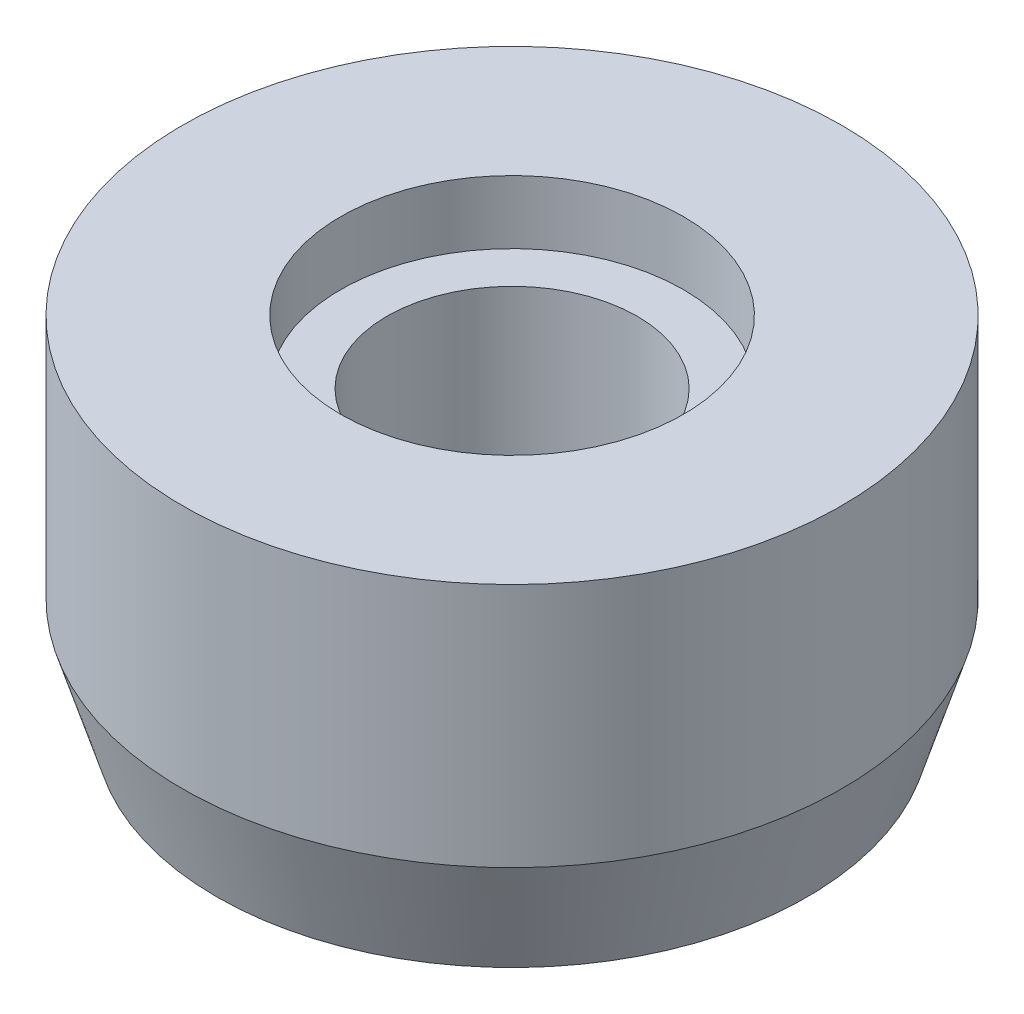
ISO-10303-21;
HEADER;
FILE_DESCRIPTION(('STEP AP214'),'2;1');
FILE_NAME('part.step','',(''),(''),'','','');
FILE_SCHEMA(('AUTOMOTIVE_DESIGN { 1 0 10303 214 1 1 1 1 }'));
ENDSEC;
DATA;
#1=APPLICATION_CONTEXT('core data for automotive mechanical design processes');
#2=APPLICATION_PROTOCOL_DEFINITION('international standard','automotive_design',2000,#1);
#3=PRODUCT_CONTEXT('',#1,'mechanical');
#4=PRODUCT('Part','Part','',(#3));
#5=PRODUCT_RELATED_PRODUCT_CATEGORY('part','',(#4));
#6=PRODUCT_DEFINITION_FORMATION('','',#4);
#7=PRODUCT_DEFINITION_CONTEXT('part definition',#1,'design');
#8=PRODUCT_DEFINITION('design','',#6,#7);
#9=PRODUCT_DEFINITION_SHAPE('','',#8);
#10=(LENGTH_UNIT() NAMED_UNIT(*) SI_UNIT(.MILLI.,.METRE.));
#11=(NAMED_UNIT(*) PLANE_ANGLE_UNIT() SI_UNIT($,.RADIAN.));
#12=(NAMED_UNIT(*) SI_UNIT($,.STERADIAN.) SOLID_ANGLE_UNIT());
#13=UNCERTAINTY_MEASURE_WITH_UNIT(LENGTH_MEASURE(1.E-05),#10,'distance_accuracy_value','');
#14=(GEOMETRIC_REPRESENTATION_CONTEXT(3) GLOBAL_UNCERTAINTY_ASSIGNED_CONTEXT((#13)) GLOBAL_UNIT_ASSIGNED_CONTEXT((#10,
#11,#12)) REPRESENTATION_CONTEXT('',''));
#15=CARTESIAN_POINT('',(0.,0.,0.));
#16=DIRECTION('',(0.,0.,1.));
#17=DIRECTION('',(1.,0.,0.));
#18=AXIS2_PLACEMENT_3D('',#15,#16,#17);
#19=CARTESIAN_POINT('',(0.,-13.5,0.));
#20=DIRECTION('',(0.,-1.,0.));
#21=DIRECTION('',(0.,0.,-1.));
#22=AXIS2_PLACEMENT_3D('',#19,#20,#21);
#23=CYLINDRICAL_SURFACE('',#22,12.5);
#24=CARTESIAN_POINT('',(0.,0.,0.));
#25=DIRECTION('',(0.,-1.,0.));
#26=DIRECTION('',(0.,0.,-1.));
#27=AXIS2_PLACEMENT_3D('',#24,#25,#26);
#28=CIRCLE('',#27,12.5);
#29=CARTESIAN_POINT('',(0.,0.,-12.5));
#30=VERTEX_POINT('',#29);
#31=EDGE_CURVE('E10',#30,#30,#28,.T.);
#32=ORIENTED_EDGE('',*,*,#31,.T.);
#33=EDGE_LOOP('',(#32));
#34=FACE_BOUND('',#33,.T.);
#35=CARTESIAN_POINT('',(0.,-9.3,0.));
#36=DIRECTION('',(0.,-1.,0.));
#37=DIRECTION('',(0.,0.,-1.));
#38=AXIS2_PLACEMENT_3D('',#35,#36,#37);
#39=CIRCLE('',#38,12.5);
#40=CARTESIAN_POINT('',(0.,-9.3,-12.5));
#41=VERTEX_POINT('',#40);
#42=EDGE_CURVE('E53',#41,#41,#39,.T.);
#43=ORIENTED_EDGE('',*,*,#42,.F.);
#44=EDGE_LOOP('',(#43));
#45=FACE_BOUND('',#44,.T.);
#46=ADVANCED_FACE('F28',(#34,#45),#23,.T.);
#47=CARTESIAN_POINT('',(12.5,0.,0.));
#48=DIRECTION('',(0.,1.,0.));
#49=DIRECTION('',(0.,0.,1.));
#50=AXIS2_PLACEMENT_3D('',#47,#48,#49);
#51=PLANE('',#50);
#52=CARTESIAN_POINT('',(0.,0.,0.));
#53=DIRECTION('',(0.,-1.,0.));
#54=DIRECTION('',(0.,0.,-1.));
#55=AXIS2_PLACEMENT_3D('',#52,#53,#54);
#56=CIRCLE('',#55,6.5);
#57=CARTESIAN_POINT('',(0.,0.,-6.5));
#58=VERTEX_POINT('',#57);
#59=EDGE_CURVE('E34',#58,#58,#56,.T.);
#60=ORIENTED_EDGE('',*,*,#59,.T.);
#61=EDGE_LOOP('',(#60));
#62=FACE_BOUND('',#61,.T.);
#63=ORIENTED_EDGE('',*,*,#31,.F.);
#64=EDGE_LOOP('',(#63));
#65=FACE_BOUND('',#64,.T.);
#66=ADVANCED_FACE('F61',(#62,#65),#51,.T.);
#67=CARTESIAN_POINT('',(0.,-13.5,0.));
#68=DIRECTION('',(0.,-1.,0.));
#69=DIRECTION('',(0.,0.,-1.));
#70=AXIS2_PLACEMENT_3D('',#67,#68,#69);
#71=CYLINDRICAL_SURFACE('',#70,6.5);
#72=CARTESIAN_POINT('',(0.,-2.4,0.));
#73=DIRECTION('',(0.,-1.,0.));
#74=DIRECTION('',(0.,0.,-1.));
#75=AXIS2_PLACEMENT_3D('',#72,#73,#74);
#76=CIRCLE('',#75,6.5);
#77=CARTESIAN_POINT('',(0.,-2.4,-6.5));
#78=VERTEX_POINT('',#77);
#79=EDGE_CURVE('E38',#78,#78,#76,.T.);
#80=ORIENTED_EDGE('',*,*,#79,.T.);
#81=EDGE_LOOP('',(#80));
#82=FACE_BOUND('',#81,.T.);
#83=ORIENTED_EDGE('',*,*,#59,.F.);
#84=EDGE_LOOP('',(#83));
#85=FACE_BOUND('',#84,.T.);
#86=ADVANCED_FACE('F65',(#82,#85),#71,.F.);
#87=CARTESIAN_POINT('',(6.5,-2.4,0.));
#88=DIRECTION('',(0.,1.,0.));
#89=DIRECTION('',(0.,0.,1.));
#90=AXIS2_PLACEMENT_3D('',#87,#88,#89);
#91=PLANE('',#90);
#92=CARTESIAN_POINT('',(0.,-2.4,0.));
#93=DIRECTION('',(0.,-1.,0.));
#94=DIRECTION('',(0.,0.,-1.));
#95=AXIS2_PLACEMENT_3D('',#92,#93,#94);
#96=CIRCLE('',#95,4.75);
#97=CARTESIAN_POINT('',(0.,-2.4,-4.75));
#98=VERTEX_POINT('',#97);
#99=EDGE_CURVE('E42',#98,#98,#96,.T.);
#100=ORIENTED_EDGE('',*,*,#99,.T.);
#101=EDGE_LOOP('',(#100));
#102=FACE_BOUND('',#101,.T.);
#103=ORIENTED_EDGE('',*,*,#79,.F.);
#104=EDGE_LOOP('',(#103));
#105=FACE_BOUND('',#104,.T.);
#106=ADVANCED_FACE('F69',(#102,#105),#91,.T.);
#107=CARTESIAN_POINT('',(0.,-13.5,0.));
#108=DIRECTION('',(0.,-1.,0.));
#109=DIRECTION('',(0.,0.,-1.));
#110=AXIS2_PLACEMENT_3D('',#107,#108,#109);
#111=CYLINDRICAL_SURFACE('',#110,4.75);
#112=CARTESIAN_POINT('',(0.,-13.5,0.));
#113=DIRECTION('',(0.,-1.,0.));
#114=DIRECTION('',(0.,0.,-1.));
#115=AXIS2_PLACEMENT_3D('',#112,#113,#114);
#116=CIRCLE('',#115,4.75);
#117=CARTESIAN_POINT('',(0.,-13.5,-4.75));
#118=VERTEX_POINT('',#117);
#119=EDGE_CURVE('E47',#118,#118,#116,.T.);
#120=ORIENTED_EDGE('',*,*,#119,.T.);
#121=EDGE_LOOP('',(#120));
#122=FACE_BOUND('',#121,.T.);
#123=ORIENTED_EDGE('',*,*,#99,.F.);
#124=EDGE_LOOP('',(#123));
#125=FACE_BOUND('',#124,.T.);
#126=ADVANCED_FACE('F76',(#122,#125),#111,.F.);
#127=CARTESIAN_POINT('',(4.75,-13.5,0.));
#128=DIRECTION('',(0.,-1.,0.));
#129=DIRECTION('',(0.,0.,-1.));
#130=AXIS2_PLACEMENT_3D('',#127,#128,#129);
#131=PLANE('',#130);
#132=CARTESIAN_POINT('',(0.,-13.5,0.));
#133=DIRECTION('',(0.,-1.,0.));
#134=DIRECTION('',(0.,0.,-1.));
#135=AXIS2_PLACEMENT_3D('',#132,#133,#134);
#136=CIRCLE('',#135,11.2);
#137=CARTESIAN_POINT('',(0.,-13.5,-11.2));
#138=VERTEX_POINT('',#137);
#139=EDGE_CURVE('E50',#138,#138,#136,.T.);
#140=ORIENTED_EDGE('',*,*,#139,.T.);
#141=EDGE_LOOP('',(#140));
#142=FACE_BOUND('',#141,.T.);
#143=ORIENTED_EDGE('',*,*,#119,.F.);
#144=EDGE_LOOP('',(#143));
#145=FACE_BOUND('',#144,.T.);
#146=ADVANCED_FACE('F80',(#142,#145),#131,.T.);
#147=CARTESIAN_POINT('',(0.,-13.5,0.));
#148=DIRECTION('',(0.,1.,0.));
#149=DIRECTION('',(0.,0.,1.));
#150=AXIS2_PLACEMENT_3D('',#147,#148,#149);
#151=CONICAL_SURFACE('',#150,11.2,0.300171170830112);
#152=ORIENTED_EDGE('',*,*,#42,.T.);
#153=EDGE_LOOP('',(#152));
#154=FACE_BOUND('',#153,.T.);
#155=ORIENTED_EDGE('',*,*,#139,.F.);
#156=EDGE_LOOP('',(#155));
#157=FACE_BOUND('',#156,.T.);
#158=ADVANCED_FACE('F57',(#154,#157),#151,.T.);
#159=CLOSED_SHELL('',(#46,#66,#86,#106,#126,#146,#158));
#160=MANIFOLD_SOLID_BREP('B2',#159);
#161=ADVANCED_BREP_SHAPE_REPRESENTATION('',(#18,#160),#14);
#162=SHAPE_DEFINITION_REPRESENTATION(#9,#161);
ENDSEC;
END-ISO-10303-21;
